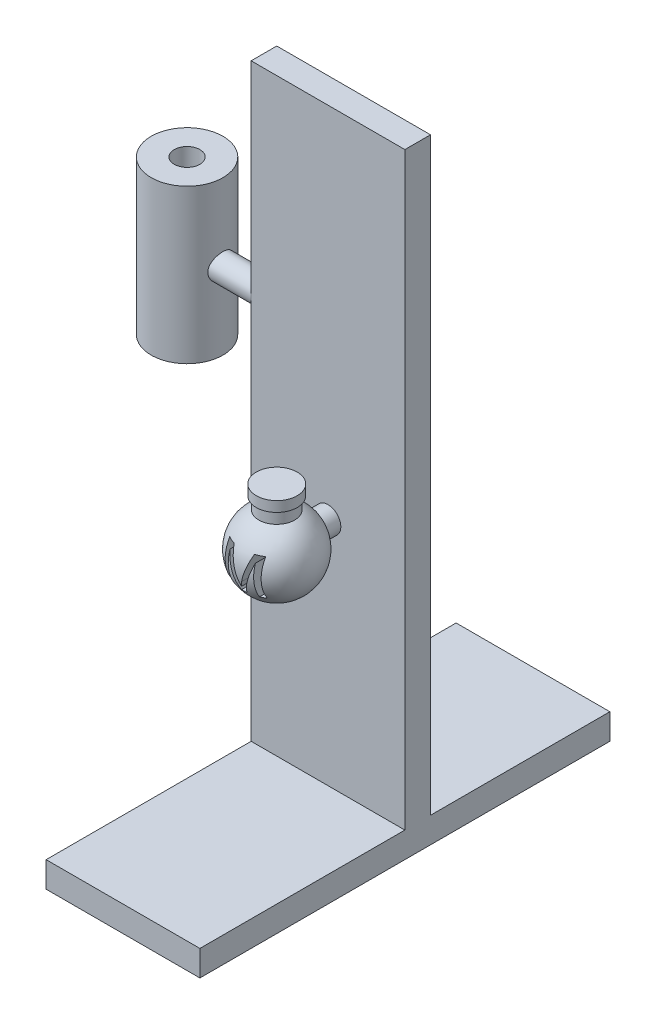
from build123d import *

# Parameters (mm, degrees)
ESQUISSE1_W             = 30
ESQUISSE1_H             = 120
BASE_EXTRUSION_DEPTH    = 5
ESQUISSE2_R             = 2.5
BOSS_EXTRU_1_DEPTH      = 10
ESQUISSE4_R             = 3.5
BOSS_EXTRU_2_DEPTH      = 9
ESQUISSE5_R             = 4
BOSS_EXTRU_3_DEPTH      = 2
ESQUISSE6_R             = 2.5
BOSS_EXTRU_4_DEPTH      = 15
ESQUISSE7_W             = 7
ESQUISSE7_H             = 30
BOSS_EXTRU_6_DEPTH      = 40
BOSS_EXTRU_6_DEPTH_BACK = 40
ESQUISSE9_W             = 30
ESQUISSE9_H             = 5
ESQUISSE10_R            = 2.5
ENL_V_MAT_EXTRU_1_DEPTH = 33
ENL_V_MAT_EXTRU_2_DEPTH = 18.576782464


with BuildPart() as part:
    # Esquisse1 → Base-Extrusion (new body)
    with BuildSketch(Plane.XY):
        with Locations((15, 60)):
            Rectangle(ESQUISSE1_W, ESQUISSE1_H)
    extrude(amount=BASE_EXTRUSION_DEPTH)

    # Esquisse2 → Boss.-Extru.1 (add)
    with BuildSketch(Plane.XY.offset(5)):
        with Locations(Location((15, 50, 0), (0, 0, 180))):
            Circle(ESQUISSE2_R)
    extrude(amount=BOSS_EXTRU_1_DEPTH)

    # Esquisse3 → Boss.-R_vol.1 (revolve)
    with BuildSketch(Plane.XY.offset(15)):
        with BuildLine():
            Line((15, 42.5), (15, 57.5))
            ThreePointArc((15, 57.5), (7.5, 50), (15, 42.5))
        make_face()
    revolve(axis=Axis((15, 68.072289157, 15), (0, -1, 0)))

    # Esquisse4 → Boss.-Extru.2 (add)
    with BuildSketch(Plane.XZ.offset(-50)):
        with Locations(Location((15, 15, 0), (0, 0, 270))):
            Circle(ESQUISSE4_R)
    extrude(amount=-BOSS_EXTRU_2_DEPTH)

    # Esquisse5 → Boss.-Extru.3 (add)
    with BuildSketch(Plane(origin=(0, 59, 0), x_dir=(-1, 0, 0), z_dir=(0, 1, 0))):
        with Locations(Location((-15, 15, 0), (0, 0, 90))):
            Circle(ESQUISSE5_R)
    extrude(amount=BOSS_EXTRU_3_DEPTH)

    # Esquisse6 → Boss.-Extru.4 (add)
    with BuildSketch(Plane.ZY):
        with Locations((2.5, 80)):
            Circle(ESQUISSE6_R)
    extrude(amount=BOSS_EXTRU_4_DEPTH)

    # Esquisse7 → Boss.-R_vol.2 (revolve)
    with BuildSketch(Plane.XY.offset(2.5), mode=Mode.PRIVATE) as boss_r_vol_2_sk:
        with Locations((-11.5, 80)):
            Rectangle(ESQUISSE7_W, ESQUISSE7_H)
    revolve(boss_r_vol_2_sk.sketch.rotate(Axis((-15, 101.070950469, 2.5), (0, -1, 0)), 180), axis=Axis((-15, 101.070950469, 2.5), (0, -1, 0)))

    # Esquisse9 → Boss.-Extru.6 (add, two sides: drawn at the far end of the back side and taken through both)
    with BuildSketch(Plane.XY.offset(5).offset(-BOSS_EXTRU_6_DEPTH_BACK)):
        with Locations((15, 2.5)):
            Rectangle(ESQUISSE9_W, ESQUISSE9_H)
    extrude(amount=BOSS_EXTRU_6_DEPTH + BOSS_EXTRU_6_DEPTH_BACK)

    # Esquisse10 → Enl_v. mat.-Extru.1 (cut)
    with BuildSketch(Plane(origin=(0, 95, 0), x_dir=(-1, 0, 0), z_dir=(0, 1, 0))):
        with Locations((15, 2.5)):
            Circle(ESQUISSE10_R)
    extrude(amount=-ENL_V_MAT_EXTRU_1_DEPTH, mode=Mode.SUBTRACT)

    # Esquisse11 → Enl_v. mat.-Extru.2 (cut)
    with BuildSketch(Plane.XY.offset(17)):
        with BuildLine():
            Line((11.640602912, 46.132262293), (11.640602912, 53.323554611))
            Line((11.640602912, 53.323554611), (13.166159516, 53.323554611))
            Line((13.166159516, 53.323554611), (14.773828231, 48.277261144))
            add(Edge.make_bspline(
                [(14.773828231, 48.277261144), (14.791520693, 48.220095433), (14.825736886, 48.109540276), (14.87647544, 47.949888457), (14.922639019, 47.801527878), (14.96421659, 47.663986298), (15.003453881, 47.537946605), (15.037427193, 47.422374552), (15.069906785, 47.318554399), (15.088941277, 47.252573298), (15.097954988, 47.221328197)],
                knots=[0, 0, 0, 0, 1.300204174, 2.514519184, 3.639827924, 4.676153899, 5.636536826, 6.507959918, 7.293450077, 8, 8, 8, 8], degree=3))
            add(Edge.make_bspline(
                [(15.097954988, 47.221328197), (15.107994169, 47.255434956), (15.12935819, 47.328016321), (15.163992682, 47.442138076), (15.200844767, 47.568426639), (15.244945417, 47.704711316), (15.290915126, 47.853129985), (15.339166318, 48.013559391), (15.394823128, 48.184397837), (15.43180986, 48.30267192), (15.450893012, 48.363694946)],
                knots=[0, 0, 0, 0, 0.713638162, 1.518667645, 2.393860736, 3.354087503, 4.393659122, 5.512594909, 6.716633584, 8, 8, 8, 8], degree=3))
            Line((15.450893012, 48.363694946), (17.042715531, 53.323554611))
            Line((17.042715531, 53.323554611), (18.555307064, 53.323554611))
            Line((18.555307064, 53.323554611), (18.555307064, 46.132262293))
            Line((18.555307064, 46.132262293), (17.541150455, 46.132262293))
            Line((17.541150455, 46.132262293), (17.541150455, 52.217201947))
            Line((17.541150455, 52.217201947), (15.622320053, 46.132262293))
            Line((15.622320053, 46.132262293), (14.562065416, 46.132262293))
            Line((14.562065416, 46.132262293), (12.654759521, 52.217201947))
            Line((12.654759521, 52.217201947), (12.654759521, 46.132262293))
            Line((12.654759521, 46.132262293), (11.640602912, 46.132262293))
        make_face()
    extrude(amount=ENL_V_MAT_EXTRU_2_DEPTH, mode=Mode.SUBTRACT)


solid = part.part
